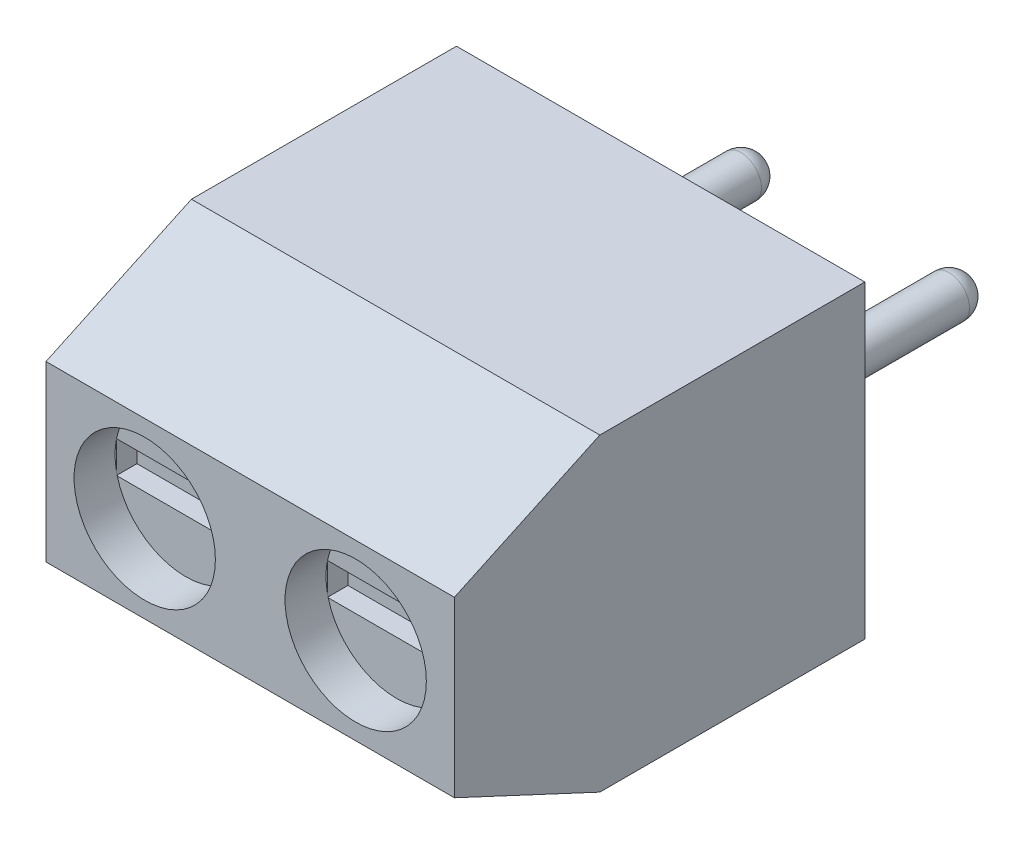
from build123d import *
from OCP.BRepFilletAPI import BRepFilletAPI_MakeChamfer

# Parameters (mm, degrees)
ESQUISSE1_W             = 9.97
ESQUISSE1_H             = 7.55
EXTRUSION1_DEPTH        = 10.02
CHANFREIN1_SIZE         = 3.55
CHANFREIN1_SIZE2        = 1.655392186
ESQUISSE2_R             = 1.725
ENL_V_MAT_EXTRU_1_DEPTH = 1
ESQUISSE3_W             = 4
ESQUISSE3_H             = 5
ENL_V_MAT_EXTRU_2_DEPTH = 1.6
ESQUISSE4_R             = 1.675
ENL_V_MAT_EXTRU_3_DEPTH = 1.6
ESQUISSE5_R             = 0.5
EXTRUSION2_DEPTH        = 5
CONG_1_R                = 0.5
ESQUISSE7_W             = 3.359641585
ESQUISSE7_H             = 0.780050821
ENL_V_MAT_EXTRU_4_DEPTH = 0.5
ESQUISSE8_W             = 3.1960084
ESQUISSE8_H             = 1.003036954
ENL_V_MAT_EXTRU_5_DEPTH = 0.5


with BuildPart() as part:
    # Esquisse1 → Extrusion1 (new body)
    with BuildSketch(Plane.XY):
        with Locations((4.985, 3.775)):
            Rectangle(ESQUISSE1_W, ESQUISSE1_H)
    extrude(amount=EXTRUSION1_DEPTH)

    # Chanfrein1: one chamfer whose edges measure the first distance from different faces: ONE call of the kernel's chamfer builder (chamfer() names one face for all edges)
    chanfrein1_edges_1 = [part.edges().sort_by_distance(p)[0] for p in [
        (4.985, 7.55, 10.02),
    ]]
    chanfrein1_side_1 = [part.faces().sort_by_distance(p)[0] for p in [
        (4.985, 7.55, 5.01),
    ]]
    chanfrein1_edges_2 = [part.edges().sort_by_distance(p)[0] for p in [
        (4.985, 0, 10.02),
    ]]
    chanfrein1_side_2 = [part.faces().sort_by_distance(p)[0] for p in [
        (4.985, 0, 5.01),
    ]]
    chanfrein1 = BRepFilletAPI_MakeChamfer(part.part.solid().wrapped)
    for e in chanfrein1_edges_1:
        chanfrein1.Add(CHANFREIN1_SIZE, CHANFREIN1_SIZE2, e.wrapped, chanfrein1_side_1[0].wrapped)  # the first distance lies on this face
    for e in chanfrein1_edges_2:
        chanfrein1.Add(CHANFREIN1_SIZE, CHANFREIN1_SIZE2, e.wrapped, chanfrein1_side_2[0].wrapped)  # the first distance lies on this face
    add(Compound.cast(chanfrein1.Shape()), mode=Mode.REPLACE)

    # Esquisse2 → Enl_v. mat.-Extru.1 (cut)
    with BuildSketch(Plane.XY.offset(10.02)):
        with Locations((2.410120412, 3.775)):
            Circle(ESQUISSE2_R)
        with Locations((7.559879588, 3.775)):
            Circle(ESQUISSE2_R)
    extrude(amount=-ENL_V_MAT_EXTRU_1_DEPTH, mode=Mode.SUBTRACT)

    # Esquisse3 → Enl_v. mat.-Extru.2 (cut)
    with BuildSketch(Plane.XZ):
        with Locations((7.435, 3.3)):
            Rectangle(ESQUISSE3_W, ESQUISSE3_H)
        with Locations((2.535, 3.3)):
            Rectangle(ESQUISSE3_W, ESQUISSE3_H)
    extrude(amount=-ENL_V_MAT_EXTRU_2_DEPTH, mode=Mode.SUBTRACT)

    # Esquisse4 → Enl_v. mat.-Extru.3 (cut)
    with BuildSketch(Plane.XZ.offset(-1.6)):
        with Locations(Location((7.435, 3.235, 0), (0, 0, 270))):
            Circle(ESQUISSE4_R)
        with Locations(Location((2.535, 3.235, 0), (0, 0, 270))):
            Circle(ESQUISSE4_R)
    extrude(amount=-ENL_V_MAT_EXTRU_3_DEPTH, mode=Mode.SUBTRACT)

    # Esquisse5 → Extrusion2 (add)
    with BuildSketch(Plane(origin=(0, 0, 0), x_dir=(-1, 0, 0), z_dir=(0, 0, -1))):
        with Locations((-7.525, 3.775)):
            Circle(ESQUISSE5_R)
        with Locations((-2.445, 3.775)):
            Circle(ESQUISSE5_R)
    extrude(amount=EXTRUSION2_DEPTH)

    # Cong_1
    cong_1_edges = [part.edges().sort_by_distance(p)[0] for p in [
        (8.025, 3.775, -5),
        (2.945, 3.775, -5),
    ]]
    fillet(cong_1_edges, radius=CONG_1_R)

    # Esquisse7 → Enl_v. mat.-Extru.4 (cut)
    with BuildSketch(Plane.XY.offset(9.02)):
        with Locations((2.40077537, 3.734751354)):
            Rectangle(ESQUISSE7_W, ESQUISSE7_H)
        with Locations((7.550534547, 3.734751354)):
            Rectangle(ESQUISSE7_W, ESQUISSE7_H)
    extrude(amount=-ENL_V_MAT_EXTRU_4_DEPTH, mode=Mode.SUBTRACT)

    # Esquisse8 → Enl_v. mat.-Extru.5 (cut)
    with BuildSketch(Plane.XZ.offset(-3.2)):
        with Locations((2.54160667, 3.256051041)):
            Rectangle(ESQUISSE8_W, ESQUISSE8_H)
        with Locations((7.44160667, 3.256051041)):
            Rectangle(ESQUISSE8_W, ESQUISSE8_H)
    extrude(amount=-ENL_V_MAT_EXTRU_5_DEPTH, mode=Mode.SUBTRACT)


solid = part.part
